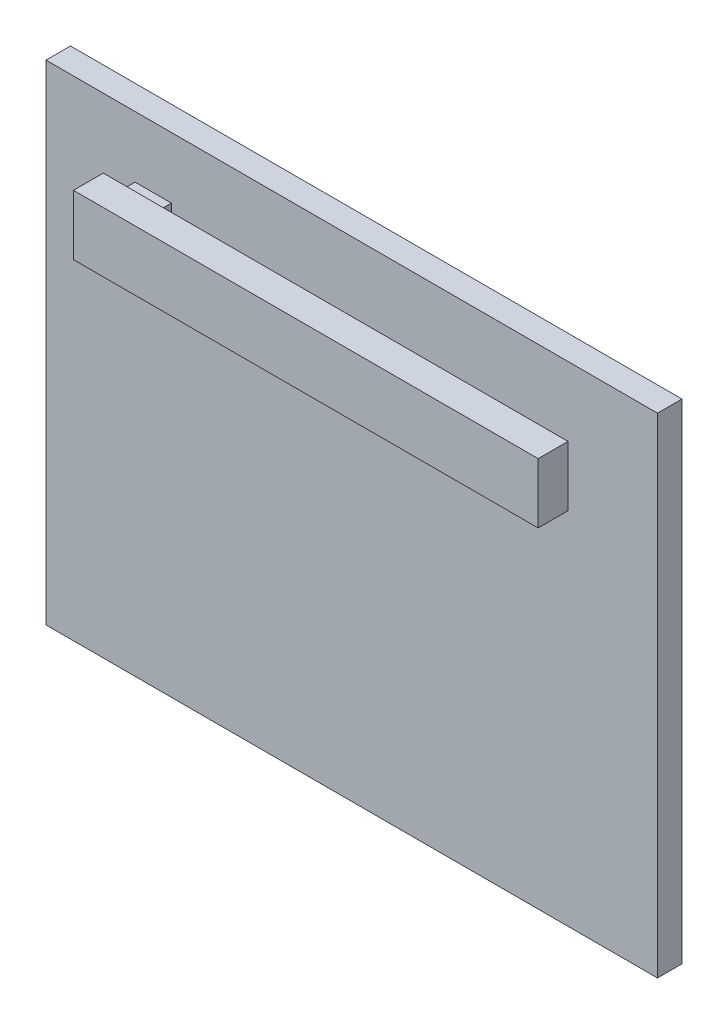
from build123d import *

# Parameters (mm, degrees)
SKETCH1_W                = 50
SKETCH1_H                = 40
BOSS_EXTRUDE1_DEPTH      = 2
SKETCH2_W                = 2.97
SKETCH2_H                = 2.97
BOSS_EXTRUDE2_DEPTH      = 2.6
BOSS_EXTRUDE4_DEPTH      = 1
BOSS_EXTRUDE4_DEPTH_BACK = 38
SKETCH4_W                = 2.44
SKETCH4_H                = 4.91
SKETCH5_W                = 0.998847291
SKETCH5_H                = 2.44
CUT_EXTRUDE1_DEPTH       = 10


with BuildPart() as part:
    # Sketch1 → Boss-Extrude1 (new body)
    with BuildSketch(Plane.XY):
        Rectangle(SKETCH1_W, SKETCH1_H)
    extrude(amount=BOSS_EXTRUDE1_DEPTH)

    # Sketch2 → Boss-Extrude2 (add)
    with BuildSketch(Plane.XY.offset(2)):
        with Locations((-16.233220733, 13.516426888)):
            Rectangle(SKETCH2_W, SKETCH2_H)
    extrude(amount=BOSS_EXTRUDE2_DEPTH)

    # Sketch4 → Boss-Extrude4 (add, two sides: drawn at the far end of the back side and taken through both)
    with BuildSketch(Plane.ZY.offset(17.718220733).offset(-BOSS_EXTRUDE4_DEPTH_BACK)):
        with Locations((5.82, 14.486426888)):
            Rectangle(SKETCH4_W, SKETCH4_H)
    extrude(amount=BOSS_EXTRUDE4_DEPTH + BOSS_EXTRUDE4_DEPTH_BACK)

    # Sketch5 → Cut-Extrude1 (cut)
    with BuildSketch(Plane(origin=(0, 16.941426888, 0), x_dir=(1, 0, 0), z_dir=(0, 1, 0))):
        with Locations((-18.218797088, -5.82)):
            Rectangle(SKETCH5_W, SKETCH5_H)
    extrude(amount=-CUT_EXTRUDE1_DEPTH, mode=Mode.SUBTRACT)


solid = part.part
